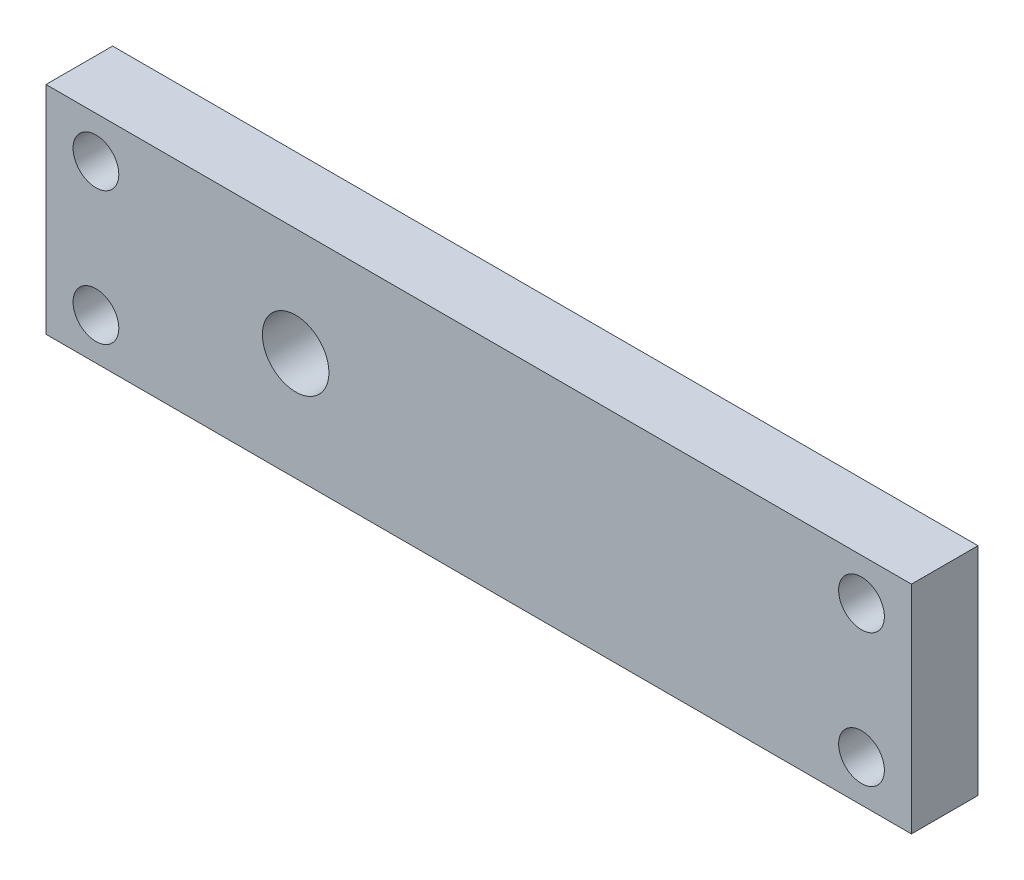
from build123d import *

# Parameters (mm, degrees)
ESQUISSE1_W             = 104
ESQUISSE1_H             = 26
EXTRUSION1_DEPTH        = 8
ESQUISSE2_R             = 4
ENL_V_MAT_EXTRU_1_DEPTH = 108.498837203
D_GAGEMENT_M51_D        = 5.5
D_GAGEMENT_M51_DEPTH    = 62.5
D_GAGEMENT_M51_TIP      = 1.652366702


with BuildPart() as part:
    # Esquisse1 → Extrusion1 (new body)
    with BuildSketch(Plane.XY):
        with Locations((52, 13)):
            Rectangle(ESQUISSE1_W, ESQUISSE1_H)
    extrude(amount=EXTRUSION1_DEPTH)

    # Esquisse2 → Enl_v. mat.-Extru.1 (cut, through all)
    with BuildSketch(Plane.XY.offset(8)):
        with Locations((30, 13)):
            Circle(ESQUISSE2_R)
    extrude(amount=-ENL_V_MAT_EXTRU_1_DEPTH, mode=Mode.SUBTRACT)

    # D_gagement M51
    with Locations(Plane.XY.offset(8)):
        with Locations((6, 21), (6, 5), (98, 21), (98, 5)):
            Hole(D_GAGEMENT_M51_D / 2, depth=D_GAGEMENT_M51_DEPTH)
            with Locations((0, 0, -(D_GAGEMENT_M51_DEPTH + D_GAGEMENT_M51_TIP / 2))):  # 118° drill point
                Cone(0, D_GAGEMENT_M51_D / 2, D_GAGEMENT_M51_TIP, mode=Mode.SUBTRACT)


solid = part.part
